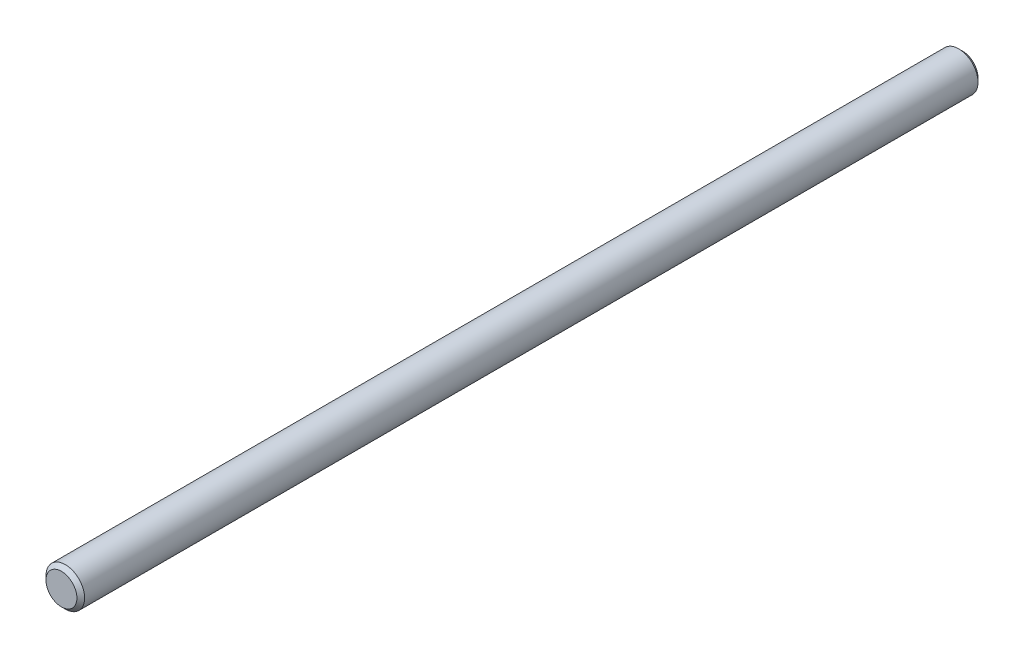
from build123d import *

# Parameters (mm, degrees)
ESQUISSE1_R      = 1.5
EXTRUSION1_DEPTH = 70
CHANFREIN1_SIZE  = 0.3


with BuildPart() as part:
    # Esquisse1 → Extrusion1 (new body)
    with BuildSketch(Plane.XY):
        Circle(ESQUISSE1_R)
    extrude(amount=EXTRUSION1_DEPTH)

    # Chanfrein1
    chanfrein1_edges = [part.edges().sort_by_distance(p)[0] for p in [
        (-1.5, 0, 0),
        (-1.5, 0, 70),
    ]]
    chamfer(chanfrein1_edges, length=CHANFREIN1_SIZE)


solid = part.part
